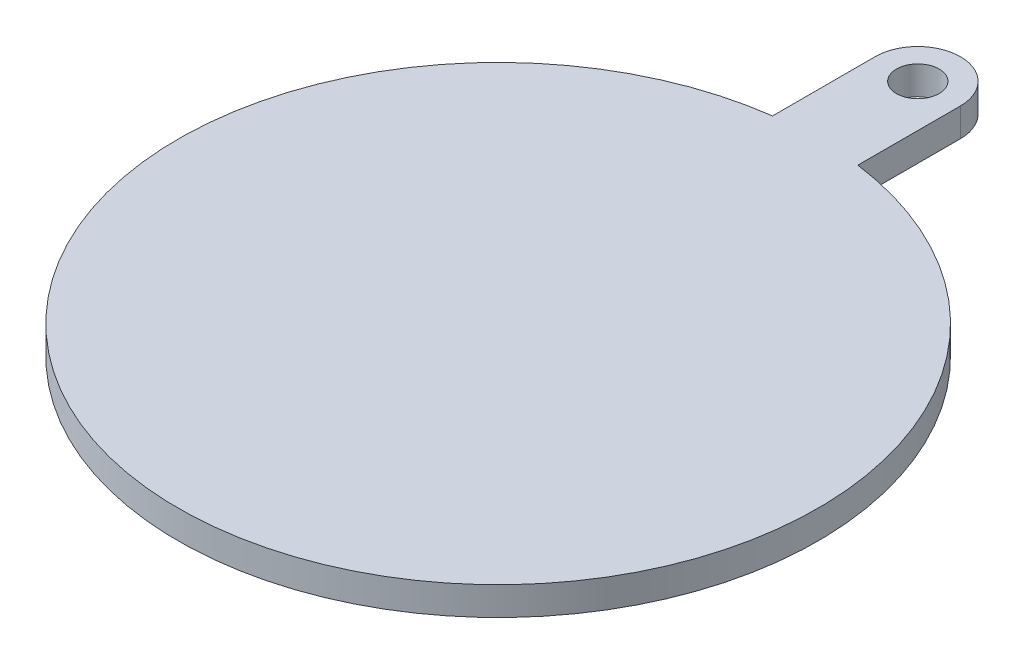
ISO-10303-21;
HEADER;
FILE_DESCRIPTION(('STEP AP214'),'2;1');
FILE_NAME('part.step','',(''),(''),'','','');
FILE_SCHEMA(('AUTOMOTIVE_DESIGN { 1 0 10303 214 1 1 1 1 }'));
ENDSEC;
DATA;
#1=APPLICATION_CONTEXT('core data for automotive mechanical design processes');
#2=APPLICATION_PROTOCOL_DEFINITION('international standard','automotive_design',2000,#1);
#3=PRODUCT_CONTEXT('',#1,'mechanical');
#4=PRODUCT('Part','Part','',(#3));
#5=PRODUCT_RELATED_PRODUCT_CATEGORY('part','',(#4));
#6=PRODUCT_DEFINITION_FORMATION('','',#4);
#7=PRODUCT_DEFINITION_CONTEXT('part definition',#1,'design');
#8=PRODUCT_DEFINITION('design','',#6,#7);
#9=PRODUCT_DEFINITION_SHAPE('','',#8);
#10=(LENGTH_UNIT() NAMED_UNIT(*) SI_UNIT(.MILLI.,.METRE.));
#11=(NAMED_UNIT(*) PLANE_ANGLE_UNIT() SI_UNIT($,.RADIAN.));
#12=(NAMED_UNIT(*) SI_UNIT($,.STERADIAN.) SOLID_ANGLE_UNIT());
#13=UNCERTAINTY_MEASURE_WITH_UNIT(LENGTH_MEASURE(1.E-05),#10,'distance_accuracy_value','');
#14=(GEOMETRIC_REPRESENTATION_CONTEXT(3) GLOBAL_UNCERTAINTY_ASSIGNED_CONTEXT((#13)) GLOBAL_UNIT_ASSIGNED_CONTEXT((#10,
#11,#12)) REPRESENTATION_CONTEXT('',''));
#15=CARTESIAN_POINT('',(0.,0.,0.));
#16=DIRECTION('',(0.,0.,1.));
#17=DIRECTION('',(1.,0.,0.));
#18=AXIS2_PLACEMENT_3D('',#15,#16,#17);
#19=CARTESIAN_POINT('',(0.,2.,0.));
#20=DIRECTION('',(0.,-1.,0.));
#21=DIRECTION('',(0.,0.,-1.));
#22=AXIS2_PLACEMENT_3D('',#19,#20,#21);
#23=CYLINDRICAL_SURFACE('',#22,22.5);
#24=CARTESIAN_POINT('',(0.,0.,0.));
#25=DIRECTION('',(0.,1.,0.));
#26=DIRECTION('',(0.,0.,1.));
#27=AXIS2_PLACEMENT_3D('',#24,#25,#26);
#28=CIRCLE('',#27,22.5);
#29=CARTESIAN_POINT('',(-3.,0.,-22.2991031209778));
#30=VERTEX_POINT('',#29);
#31=CARTESIAN_POINT('',(3.,0.,-22.2991031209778));
#32=VERTEX_POINT('',#31);
#33=EDGE_CURVE('E103',#30,#32,#28,.T.);
#34=ORIENTED_EDGE('',*,*,#33,.T.);
#35=DIRECTION('',(0.,-1.,0.));
#36=VECTOR('',#35,1.);
#37=CARTESIAN_POINT('',(3.,2.,-22.2991031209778));
#38=LINE('',#37,#36);
#39=CARTESIAN_POINT('',(3.,2.,-22.2991031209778));
#40=VERTEX_POINT('',#39);
#41=EDGE_CURVE('E11',#40,#32,#38,.T.);
#42=ORIENTED_EDGE('',*,*,#41,.F.);
#43=CARTESIAN_POINT('',(0.,2.,0.));
#44=DIRECTION('',(0.,1.,0.));
#45=DIRECTION('',(0.,0.,1.));
#46=AXIS2_PLACEMENT_3D('',#43,#44,#45);
#47=CIRCLE('',#46,22.5);
#48=CARTESIAN_POINT('',(-3.,2.,-22.2991031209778));
#49=VERTEX_POINT('',#48);
#50=EDGE_CURVE('E77',#49,#40,#47,.T.);
#51=ORIENTED_EDGE('',*,*,#50,.F.);
#52=DIRECTION('',(0.,-1.,0.));
#53=VECTOR('',#52,1.);
#54=CARTESIAN_POINT('',(-3.,2.,-22.2991031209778));
#55=LINE('',#54,#53);
#56=EDGE_CURVE('E102',#49,#30,#55,.T.);
#57=ORIENTED_EDGE('',*,*,#56,.T.);
#58=EDGE_LOOP('',(#34,#42,#51,#57));
#59=FACE_BOUND('',#58,.T.);
#60=ADVANCED_FACE('F35',(#59),#23,.T.);
#61=CARTESIAN_POINT('',(3.,2.,0.));
#62=DIRECTION('',(1.,0.,0.));
#63=DIRECTION('',(0.,0.,-1.));
#64=AXIS2_PLACEMENT_3D('',#61,#62,#63);
#65=PLANE('',#64);
#66=DIRECTION('',(0.,0.,1.));
#67=VECTOR('',#66,1.);
#68=CARTESIAN_POINT('',(3.,0.,0.));
#69=LINE('',#68,#67);
#70=CARTESIAN_POINT('',(3.,0.,-29.516295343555));
#71=VERTEX_POINT('',#70);
#72=EDGE_CURVE('E87',#71,#32,#69,.T.);
#73=ORIENTED_EDGE('',*,*,#72,.F.);
#74=DIRECTION('',(0.,-1.,0.));
#75=VECTOR('',#74,1.);
#76=CARTESIAN_POINT('',(3.,2.,-29.516295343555));
#77=LINE('',#76,#75);
#78=CARTESIAN_POINT('',(3.,2.,-29.516295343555));
#79=VERTEX_POINT('',#78);
#80=EDGE_CURVE('E43',#79,#71,#77,.T.);
#81=ORIENTED_EDGE('',*,*,#80,.F.);
#82=DIRECTION('',(0.,0.,1.));
#83=VECTOR('',#82,1.);
#84=CARTESIAN_POINT('',(3.,2.,0.));
#85=LINE('',#84,#83);
#86=EDGE_CURVE('E85',#79,#40,#85,.T.);
#87=ORIENTED_EDGE('',*,*,#86,.T.);
#88=ORIENTED_EDGE('',*,*,#41,.T.);
#89=EDGE_LOOP('',(#73,#81,#87,#88));
#90=FACE_BOUND('',#89,.T.);
#91=ADVANCED_FACE('F84',(#90),#65,.T.);
#92=CARTESIAN_POINT('',(0.,2.,-29.516295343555));
#93=DIRECTION('',(0.,-1.,0.));
#94=DIRECTION('',(0.,0.,-1.));
#95=AXIS2_PLACEMENT_3D('',#92,#93,#94);
#96=CYLINDRICAL_SURFACE('',#95,3.);
#97=CARTESIAN_POINT('',(0.,0.,-29.516295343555));
#98=DIRECTION('',(0.,1.,0.));
#99=DIRECTION('',(0.,0.,1.));
#100=AXIS2_PLACEMENT_3D('',#97,#98,#99);
#101=CIRCLE('',#100,3.);
#102=CARTESIAN_POINT('',(-3.,0.,-29.516295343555));
#103=VERTEX_POINT('',#102);
#104=EDGE_CURVE('E66',#71,#103,#101,.T.);
#105=ORIENTED_EDGE('',*,*,#104,.T.);
#106=DIRECTION('',(0.,-1.,0.));
#107=VECTOR('',#106,1.);
#108=CARTESIAN_POINT('',(-3.,2.,-29.516295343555));
#109=LINE('',#108,#107);
#110=CARTESIAN_POINT('',(-3.,2.,-29.516295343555));
#111=VERTEX_POINT('',#110);
#112=EDGE_CURVE('E88',#111,#103,#109,.T.);
#113=ORIENTED_EDGE('',*,*,#112,.F.);
#114=CARTESIAN_POINT('',(0.,2.,-29.516295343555));
#115=DIRECTION('',(0.,1.,0.));
#116=DIRECTION('',(0.,0.,1.));
#117=AXIS2_PLACEMENT_3D('',#114,#115,#116);
#118=CIRCLE('',#117,3.);
#119=EDGE_CURVE('E89',#79,#111,#118,.T.);
#120=ORIENTED_EDGE('',*,*,#119,.F.);
#121=ORIENTED_EDGE('',*,*,#80,.T.);
#122=EDGE_LOOP('',(#105,#113,#120,#121));
#123=FACE_BOUND('',#122,.T.);
#124=ADVANCED_FACE('F90',(#123),#96,.T.);
#125=CARTESIAN_POINT('',(-3.,2.,0.));
#126=DIRECTION('',(1.,0.,0.));
#127=DIRECTION('',(0.,0.,-1.));
#128=AXIS2_PLACEMENT_3D('',#125,#126,#127);
#129=PLANE('',#128);
#130=DIRECTION('',(0.,0.,1.));
#131=VECTOR('',#130,1.);
#132=CARTESIAN_POINT('',(-3.,0.,0.));
#133=LINE('',#132,#131);
#134=EDGE_CURVE('E72',#103,#30,#133,.T.);
#135=ORIENTED_EDGE('',*,*,#134,.T.);
#136=ORIENTED_EDGE('',*,*,#56,.F.);
#137=DIRECTION('',(0.,0.,1.));
#138=VECTOR('',#137,1.);
#139=CARTESIAN_POINT('',(-3.,2.,0.));
#140=LINE('',#139,#138);
#141=EDGE_CURVE('E51',#111,#49,#140,.T.);
#142=ORIENTED_EDGE('',*,*,#141,.F.);
#143=ORIENTED_EDGE('',*,*,#112,.T.);
#144=EDGE_LOOP('',(#135,#136,#142,#143));
#145=FACE_BOUND('',#144,.T.);
#146=ADVANCED_FACE('F112',(#145),#129,.F.);
#147=CARTESIAN_POINT('',(0.,2.,-29.516295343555));
#148=DIRECTION('',(0.,-1.,0.));
#149=DIRECTION('',(0.,0.,-1.));
#150=AXIS2_PLACEMENT_3D('',#147,#148,#149);
#151=CYLINDRICAL_SURFACE('',#150,1.5);
#152=CARTESIAN_POINT('',(0.,2.,-29.516295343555));
#153=DIRECTION('',(0.,1.,0.));
#154=DIRECTION('',(0.,0.,1.));
#155=AXIS2_PLACEMENT_3D('',#152,#153,#154);
#156=CIRCLE('',#155,1.5);
#157=CARTESIAN_POINT('',(0.,2.,-28.016295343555));
#158=VERTEX_POINT('',#157);
#159=EDGE_CURVE('E99',#158,#158,#156,.T.);
#160=ORIENTED_EDGE('',*,*,#159,.T.);
#161=EDGE_LOOP('',(#160));
#162=FACE_BOUND('',#161,.T.);
#163=CARTESIAN_POINT('',(0.,0.,-29.516295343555));
#164=DIRECTION('',(0.,1.,0.));
#165=DIRECTION('',(0.,0.,1.));
#166=AXIS2_PLACEMENT_3D('',#163,#164,#165);
#167=CIRCLE('',#166,1.5);
#168=CARTESIAN_POINT('',(0.,0.,-28.016295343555));
#169=VERTEX_POINT('',#168);
#170=EDGE_CURVE('E95',#169,#169,#167,.T.);
#171=ORIENTED_EDGE('',*,*,#170,.F.);
#172=EDGE_LOOP('',(#171));
#173=FACE_BOUND('',#172,.T.);
#174=ADVANCED_FACE('F129',(#162,#173),#151,.F.);
#175=CARTESIAN_POINT('',(0.,2.,0.));
#176=DIRECTION('',(0.,1.,0.));
#177=DIRECTION('',(0.,0.,1.));
#178=AXIS2_PLACEMENT_3D('',#175,#176,#177);
#179=PLANE('',#178);
#180=ORIENTED_EDGE('',*,*,#50,.T.);
#181=ORIENTED_EDGE('',*,*,#86,.F.);
#182=ORIENTED_EDGE('',*,*,#119,.T.);
#183=ORIENTED_EDGE('',*,*,#141,.T.);
#184=EDGE_LOOP('',(#180,#181,#182,#183));
#185=FACE_BOUND('',#184,.T.);
#186=ORIENTED_EDGE('',*,*,#159,.F.);
#187=EDGE_LOOP('',(#186));
#188=FACE_BOUND('',#187,.T.);
#189=ADVANCED_FACE('F92',(#185,#188),#179,.T.);
#190=CARTESIAN_POINT('',(0.,0.,0.));
#191=DIRECTION('',(0.,1.,0.));
#192=DIRECTION('',(0.,0.,1.));
#193=AXIS2_PLACEMENT_3D('',#190,#191,#192);
#194=PLANE('',#193);
#195=ORIENTED_EDGE('',*,*,#33,.F.);
#196=ORIENTED_EDGE('',*,*,#134,.F.);
#197=ORIENTED_EDGE('',*,*,#104,.F.);
#198=ORIENTED_EDGE('',*,*,#72,.T.);
#199=EDGE_LOOP('',(#195,#196,#197,#198));
#200=FACE_BOUND('',#199,.T.);
#201=ORIENTED_EDGE('',*,*,#170,.T.);
#202=EDGE_LOOP('',(#201));
#203=FACE_BOUND('',#202,.T.);
#204=ADVANCED_FACE('F115',(#200,#203),#194,.F.);
#205=CLOSED_SHELL('',(#60,#91,#124,#146,#174,#189,#204));
#206=MANIFOLD_SOLID_BREP('B2',#205);
#207=ADVANCED_BREP_SHAPE_REPRESENTATION('',(#18,#206),#14);
#208=SHAPE_DEFINITION_REPRESENTATION(#9,#207);
ENDSEC;
END-ISO-10303-21;
